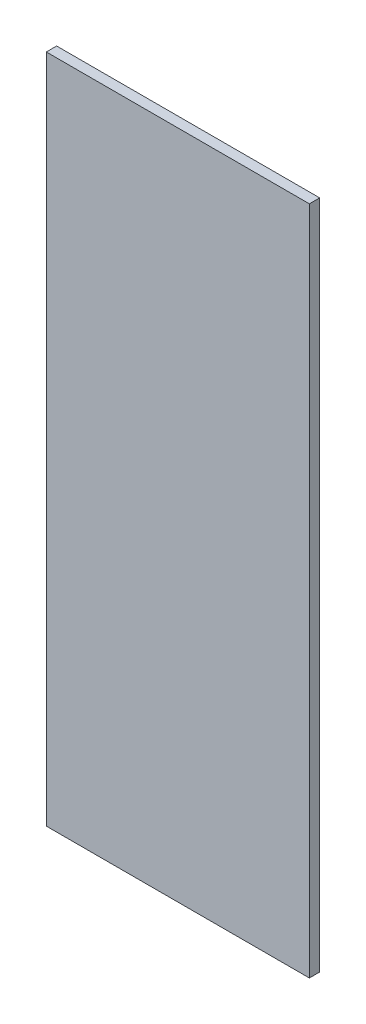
ISO-10303-21;
HEADER;
FILE_DESCRIPTION(('STEP AP214'),'2;1');
FILE_NAME('part.step','',(''),(''),'','','');
FILE_SCHEMA(('AUTOMOTIVE_DESIGN { 1 0 10303 214 1 1 1 1 }'));
ENDSEC;
DATA;
#1=APPLICATION_CONTEXT('core data for automotive mechanical design processes');
#2=APPLICATION_PROTOCOL_DEFINITION('international standard','automotive_design',2000,#1);
#3=PRODUCT_CONTEXT('',#1,'mechanical');
#4=PRODUCT('Part','Part','',(#3));
#5=PRODUCT_RELATED_PRODUCT_CATEGORY('part','',(#4));
#6=PRODUCT_DEFINITION_FORMATION('','',#4);
#7=PRODUCT_DEFINITION_CONTEXT('part definition',#1,'design');
#8=PRODUCT_DEFINITION('design','',#6,#7);
#9=PRODUCT_DEFINITION_SHAPE('','',#8);
#10=(LENGTH_UNIT() NAMED_UNIT(*) SI_UNIT(.MILLI.,.METRE.));
#11=(NAMED_UNIT(*) PLANE_ANGLE_UNIT() SI_UNIT($,.RADIAN.));
#12=(NAMED_UNIT(*) SI_UNIT($,.STERADIAN.) SOLID_ANGLE_UNIT());
#13=UNCERTAINTY_MEASURE_WITH_UNIT(LENGTH_MEASURE(1.E-05),#10,'distance_accuracy_value','');
#14=(GEOMETRIC_REPRESENTATION_CONTEXT(3) GLOBAL_UNCERTAINTY_ASSIGNED_CONTEXT((#13)) GLOBAL_UNIT_ASSIGNED_CONTEXT((#10,
#11,#12)) REPRESENTATION_CONTEXT('',''));
#15=CARTESIAN_POINT('',(0.,0.,0.));
#16=DIRECTION('',(0.,0.,1.));
#17=DIRECTION('',(1.,0.,0.));
#18=AXIS2_PLACEMENT_3D('',#15,#16,#17);
#19=CARTESIAN_POINT('',(127.5,-325.,10.));
#20=DIRECTION('',(-1.,0.,0.));
#21=DIRECTION('',(0.,-1.,0.));
#22=AXIS2_PLACEMENT_3D('',#19,#20,#21);
#23=PLANE('',#22);
#24=DIRECTION('',(0.,1.,0.));
#25=VECTOR('',#24,1.);
#26=CARTESIAN_POINT('',(127.5,-325.,0.));
#27=LINE('',#26,#25);
#28=CARTESIAN_POINT('',(127.5,-325.,0.));
#29=VERTEX_POINT('',#28);
#30=CARTESIAN_POINT('',(127.5,325.,0.));
#31=VERTEX_POINT('',#30);
#32=EDGE_CURVE('E99',#29,#31,#27,.T.);
#33=ORIENTED_EDGE('',*,*,#32,.T.);
#34=DIRECTION('',(0.,0.,-1.));
#35=VECTOR('',#34,1.);
#36=CARTESIAN_POINT('',(127.5,325.,10.));
#37=LINE('',#36,#35);
#38=CARTESIAN_POINT('',(127.5,325.,10.));
#39=VERTEX_POINT('',#38);
#40=EDGE_CURVE('E11',#39,#31,#37,.T.);
#41=ORIENTED_EDGE('',*,*,#40,.F.);
#42=DIRECTION('',(0.,1.,0.));
#43=VECTOR('',#42,1.);
#44=CARTESIAN_POINT('',(127.5,-325.,10.));
#45=LINE('',#44,#43);
#46=CARTESIAN_POINT('',(127.5,-325.,10.));
#47=VERTEX_POINT('',#46);
#48=EDGE_CURVE('E87',#47,#39,#45,.T.);
#49=ORIENTED_EDGE('',*,*,#48,.F.);
#50=DIRECTION('',(0.,0.,-1.));
#51=VECTOR('',#50,1.);
#52=CARTESIAN_POINT('',(127.5,-325.,10.));
#53=LINE('',#52,#51);
#54=EDGE_CURVE('E95',#47,#29,#53,.T.);
#55=ORIENTED_EDGE('',*,*,#54,.T.);
#56=EDGE_LOOP('',(#33,#41,#49,#55));
#57=FACE_BOUND('',#56,.T.);
#58=ADVANCED_FACE('F36',(#57),#23,.F.);
#59=CARTESIAN_POINT('',(127.5,325.,10.));
#60=DIRECTION('',(0.,-1.,0.));
#61=DIRECTION('',(0.,0.,-1.));
#62=AXIS2_PLACEMENT_3D('',#59,#60,#61);
#63=PLANE('',#62);
#64=DIRECTION('',(-1.,0.,0.));
#65=VECTOR('',#64,1.);
#66=CARTESIAN_POINT('',(127.5,325.,0.));
#67=LINE('',#66,#65);
#68=CARTESIAN_POINT('',(-127.5,325.,0.));
#69=VERTEX_POINT('',#68);
#70=EDGE_CURVE('E91',#31,#69,#67,.T.);
#71=ORIENTED_EDGE('',*,*,#70,.T.);
#72=DIRECTION('',(0.,0.,-1.));
#73=VECTOR('',#72,1.);
#74=CARTESIAN_POINT('',(-127.5,325.,10.));
#75=LINE('',#74,#73);
#76=CARTESIAN_POINT('',(-127.5,325.,10.));
#77=VERTEX_POINT('',#76);
#78=EDGE_CURVE('E44',#77,#69,#75,.T.);
#79=ORIENTED_EDGE('',*,*,#78,.F.);
#80=DIRECTION('',(-1.,0.,0.));
#81=VECTOR('',#80,1.);
#82=CARTESIAN_POINT('',(127.5,325.,10.));
#83=LINE('',#82,#81);
#84=EDGE_CURVE('E82',#39,#77,#83,.T.);
#85=ORIENTED_EDGE('',*,*,#84,.F.);
#86=ORIENTED_EDGE('',*,*,#40,.T.);
#87=EDGE_LOOP('',(#71,#79,#85,#86));
#88=FACE_BOUND('',#87,.T.);
#89=ADVANCED_FACE('F90',(#88),#63,.F.);
#90=CARTESIAN_POINT('',(-127.5,-325.,10.));
#91=DIRECTION('',(1.,0.,0.));
#92=DIRECTION('',(0.,0.,-1.));
#93=AXIS2_PLACEMENT_3D('',#90,#91,#92);
#94=PLANE('',#93);
#95=DIRECTION('',(0.,-1.,0.));
#96=VECTOR('',#95,1.);
#97=CARTESIAN_POINT('',(-127.5,-325.,0.));
#98=LINE('',#97,#96);
#99=CARTESIAN_POINT('',(-127.5,-325.,0.));
#100=VERTEX_POINT('',#99);
#101=EDGE_CURVE('E69',#69,#100,#98,.T.);
#102=ORIENTED_EDGE('',*,*,#101,.T.);
#103=DIRECTION('',(0.,0.,-1.));
#104=VECTOR('',#103,1.);
#105=CARTESIAN_POINT('',(-127.5,-325.,10.));
#106=LINE('',#105,#104);
#107=CARTESIAN_POINT('',(-127.5,-325.,10.));
#108=VERTEX_POINT('',#107);
#109=EDGE_CURVE('E92',#108,#100,#106,.T.);
#110=ORIENTED_EDGE('',*,*,#109,.F.);
#111=DIRECTION('',(0.,-1.,0.));
#112=VECTOR('',#111,1.);
#113=CARTESIAN_POINT('',(-127.5,-325.,10.));
#114=LINE('',#113,#112);
#115=EDGE_CURVE('E85',#77,#108,#114,.T.);
#116=ORIENTED_EDGE('',*,*,#115,.F.);
#117=ORIENTED_EDGE('',*,*,#78,.T.);
#118=EDGE_LOOP('',(#102,#110,#116,#117));
#119=FACE_BOUND('',#118,.T.);
#120=ADVANCED_FACE('F93',(#119),#94,.F.);
#121=CARTESIAN_POINT('',(127.5,-325.,10.));
#122=DIRECTION('',(0.,1.,0.));
#123=DIRECTION('',(-1.,0.,0.));
#124=AXIS2_PLACEMENT_3D('',#121,#122,#123);
#125=PLANE('',#124);
#126=DIRECTION('',(1.,0.,0.));
#127=VECTOR('',#126,1.);
#128=CARTESIAN_POINT('',(127.5,-325.,0.));
#129=LINE('',#128,#127);
#130=EDGE_CURVE('E75',#100,#29,#129,.T.);
#131=ORIENTED_EDGE('',*,*,#130,.T.);
#132=ORIENTED_EDGE('',*,*,#54,.F.);
#133=DIRECTION('',(1.,0.,0.));
#134=VECTOR('',#133,1.);
#135=CARTESIAN_POINT('',(127.5,-325.,10.));
#136=LINE('',#135,#134);
#137=EDGE_CURVE('E52',#108,#47,#136,.T.);
#138=ORIENTED_EDGE('',*,*,#137,.F.);
#139=ORIENTED_EDGE('',*,*,#109,.T.);
#140=EDGE_LOOP('',(#131,#132,#138,#139));
#141=FACE_BOUND('',#140,.T.);
#142=ADVANCED_FACE('F106',(#141),#125,.F.);
#143=CARTESIAN_POINT('',(127.5,325.,10.));
#144=DIRECTION('',(0.,0.,1.));
#145=DIRECTION('',(1.,0.,0.));
#146=AXIS2_PLACEMENT_3D('',#143,#144,#145);
#147=PLANE('',#146);
#148=ORIENTED_EDGE('',*,*,#48,.T.);
#149=ORIENTED_EDGE('',*,*,#84,.T.);
#150=ORIENTED_EDGE('',*,*,#115,.T.);
#151=ORIENTED_EDGE('',*,*,#137,.T.);
#152=EDGE_LOOP('',(#148,#149,#150,#151));
#153=FACE_BOUND('',#152,.T.);
#154=ADVANCED_FACE('F83',(#153),#147,.T.);
#155=CARTESIAN_POINT('',(127.5,325.,0.));
#156=DIRECTION('',(0.,0.,1.));
#157=DIRECTION('',(1.,0.,0.));
#158=AXIS2_PLACEMENT_3D('',#155,#156,#157);
#159=PLANE('',#158);
#160=ORIENTED_EDGE('',*,*,#32,.F.);
#161=ORIENTED_EDGE('',*,*,#130,.F.);
#162=ORIENTED_EDGE('',*,*,#101,.F.);
#163=ORIENTED_EDGE('',*,*,#70,.F.);
#164=EDGE_LOOP('',(#160,#161,#162,#163));
#165=FACE_BOUND('',#164,.T.);
#166=ADVANCED_FACE('F109',(#165),#159,.F.);
#167=CLOSED_SHELL('',(#58,#89,#120,#142,#154,#166));
#168=MANIFOLD_SOLID_BREP('B2',#167);
#169=ADVANCED_BREP_SHAPE_REPRESENTATION('',(#18,#168),#14);
#170=SHAPE_DEFINITION_REPRESENTATION(#9,#169);
ENDSEC;
END-ISO-10303-21;
